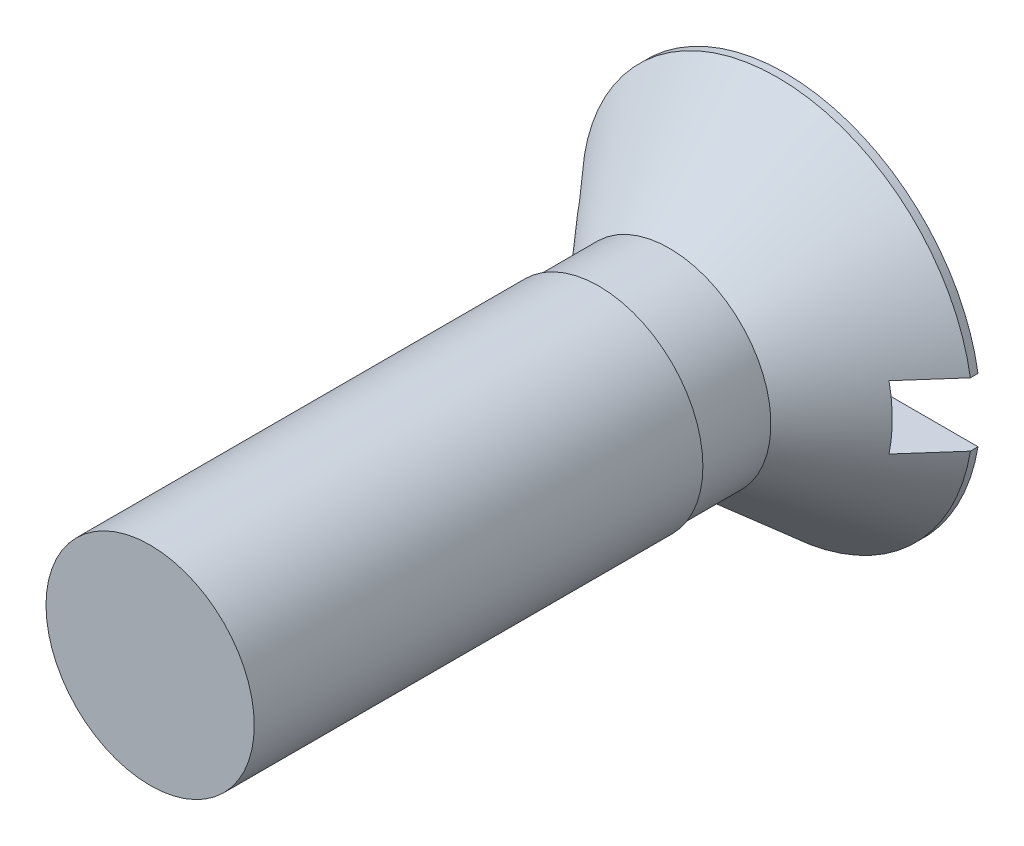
ISO-10303-21;
HEADER;
FILE_DESCRIPTION(('STEP AP214'),'2;1');
FILE_NAME('part.step','',(''),(''),'','','');
FILE_SCHEMA(('AUTOMOTIVE_DESIGN { 1 0 10303 214 1 1 1 1 }'));
ENDSEC;
DATA;
#1=APPLICATION_CONTEXT('core data for automotive mechanical design processes');
#2=APPLICATION_PROTOCOL_DEFINITION('international standard','automotive_design',2000,#1);
#3=PRODUCT_CONTEXT('',#1,'mechanical');
#4=PRODUCT('Part','Part','',(#3));
#5=PRODUCT_RELATED_PRODUCT_CATEGORY('part','',(#4));
#6=PRODUCT_DEFINITION_FORMATION('','',#4);
#7=PRODUCT_DEFINITION_CONTEXT('part definition',#1,'design');
#8=PRODUCT_DEFINITION('design','',#6,#7);
#9=PRODUCT_DEFINITION_SHAPE('','',#8);
#10=(LENGTH_UNIT() NAMED_UNIT(*) SI_UNIT(.MILLI.,.METRE.));
#11=(NAMED_UNIT(*) PLANE_ANGLE_UNIT() SI_UNIT($,.RADIAN.));
#12=(NAMED_UNIT(*) SI_UNIT($,.STERADIAN.) SOLID_ANGLE_UNIT());
#13=UNCERTAINTY_MEASURE_WITH_UNIT(LENGTH_MEASURE(1.E-05),#10,'distance_accuracy_value','');
#14=(GEOMETRIC_REPRESENTATION_CONTEXT(3) GLOBAL_UNCERTAINTY_ASSIGNED_CONTEXT((#13)) GLOBAL_UNIT_ASSIGNED_CONTEXT((#10,
#11,#12)) REPRESENTATION_CONTEXT('',''));
#15=CARTESIAN_POINT('',(0.,0.,0.));
#16=DIRECTION('',(0.,0.,1.));
#17=DIRECTION('',(1.,0.,0.));
#18=AXIS2_PLACEMENT_3D('',#15,#16,#17);
#19=CARTESIAN_POINT('',(0.,0.,0.));
#20=DIRECTION('',(0.,0.,-1.));
#21=DIRECTION('',(-1.,0.,0.));
#22=AXIS2_PLACEMENT_3D('',#19,#20,#21);
#23=PLANE('',#22);
#24=DIRECTION('',(1.,0.,0.));
#25=VECTOR('',#24,1.);
#26=CARTESIAN_POINT('',(-5.08,-0.635,0.));
#27=LINE('',#26,#25);
#28=CARTESIAN_POINT('',(-3.8597136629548,-0.635,0.));
#29=VERTEX_POINT('',#28);
#30=CARTESIAN_POINT('',(3.8597136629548,-0.635,0.));
#31=VERTEX_POINT('',#30);
#32=EDGE_CURVE('E103',#29,#31,#27,.T.);
#33=ORIENTED_EDGE('',*,*,#32,.T.);
#34=CARTESIAN_POINT('',(0.,0.,0.));
#35=DIRECTION('',(0.,0.,-1.));
#36=DIRECTION('',(-1.,0.,0.));
#37=AXIS2_PLACEMENT_3D('',#34,#35,#36);
#38=CIRCLE('',#37,3.9116);
#39=EDGE_CURVE('E110',#31,#29,#38,.T.);
#40=ORIENTED_EDGE('',*,*,#39,.T.);
#41=EDGE_LOOP('',(#33,#40));
#42=FACE_BOUND('',#41,.T.);
#43=ADVANCED_FACE('F35',(#42),#23,.T.);
#44=CARTESIAN_POINT('',(0.,0.,0.));
#45=DIRECTION('',(0.,0.,-1.));
#46=DIRECTION('',(-1.,0.,0.));
#47=AXIS2_PLACEMENT_3D('',#44,#45,#46);
#48=CYLINDRICAL_SURFACE('',#47,3.9116);
#49=DIRECTION('',(0.,0.,-1.));
#50=VECTOR('',#49,1.);
#51=CARTESIAN_POINT('',(-3.8597136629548,-0.635,0.));
#52=LINE('',#51,#50);
#53=CARTESIAN_POINT('',(-3.8597136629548,-0.635,0.1524));
#54=VERTEX_POINT('',#53);
#55=EDGE_CURVE('E64',#29,#54,#52,.F.);
#56=ORIENTED_EDGE('',*,*,#55,.F.);
#57=ORIENTED_EDGE('',*,*,#39,.F.);
#58=DIRECTION('',(0.,0.,-1.));
#59=VECTOR('',#58,1.);
#60=CARTESIAN_POINT('',(3.8597136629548,-0.635,0.));
#61=LINE('',#60,#59);
#62=CARTESIAN_POINT('',(3.85971366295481,-0.635,0.152399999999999));
#63=VERTEX_POINT('',#62);
#64=EDGE_CURVE('E222',#63,#31,#61,.T.);
#65=ORIENTED_EDGE('',*,*,#64,.F.);
#66=CARTESIAN_POINT('',(0.,0.,0.1524));
#67=DIRECTION('',(0.,0.,-1.));
#68=DIRECTION('',(-1.,0.,0.));
#69=AXIS2_PLACEMENT_3D('',#66,#67,#68);
#70=CIRCLE('',#69,3.9116);
#71=EDGE_CURVE('E205',#63,#54,#70,.T.);
#72=ORIENTED_EDGE('',*,*,#71,.T.);
#73=EDGE_LOOP('',(#56,#57,#65,#72));
#74=FACE_BOUND('',#73,.T.);
#75=ADVANCED_FACE('F153',(#74),#48,.T.);
#76=DIRECTION('',(1.,0.,0.));
#77=VECTOR('',#76,1.);
#78=CARTESIAN_POINT('',(-5.08,0.635,0.));
#79=LINE('',#78,#77);
#80=CARTESIAN_POINT('',(-3.8597136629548,0.635,0.));
#81=VERTEX_POINT('',#80);
#82=CARTESIAN_POINT('',(3.8597136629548,0.635,0.));
#83=VERTEX_POINT('',#82);
#84=EDGE_CURVE('E94',#81,#83,#79,.T.);
#85=ORIENTED_EDGE('',*,*,#84,.F.);
#86=EDGE_CURVE('E107',#81,#83,#38,.T.);
#87=ORIENTED_EDGE('',*,*,#86,.T.);
#88=EDGE_LOOP('',(#85,#87));
#89=FACE_BOUND('',#88,.T.);
#90=ADVANCED_FACE('F37',(#89),#23,.T.);
#91=DIRECTION('',(0.,0.,-1.));
#92=VECTOR('',#91,1.);
#93=CARTESIAN_POINT('',(3.8597136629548,0.635,0.));
#94=LINE('',#93,#92);
#95=CARTESIAN_POINT('',(3.8597136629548,0.635,0.1524));
#96=VERTEX_POINT('',#95);
#97=EDGE_CURVE('E102',#83,#96,#94,.F.);
#98=ORIENTED_EDGE('',*,*,#97,.F.);
#99=ORIENTED_EDGE('',*,*,#86,.F.);
#100=DIRECTION('',(0.,0.,-1.));
#101=VECTOR('',#100,1.);
#102=CARTESIAN_POINT('',(-3.8597136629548,0.635,0.));
#103=LINE('',#102,#101);
#104=CARTESIAN_POINT('',(-3.85971366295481,0.635,0.152399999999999));
#105=VERTEX_POINT('',#104);
#106=EDGE_CURVE('E91',#105,#81,#103,.T.);
#107=ORIENTED_EDGE('',*,*,#106,.F.);
#108=EDGE_CURVE('E116',#105,#96,#70,.T.);
#109=ORIENTED_EDGE('',*,*,#108,.T.);
#110=EDGE_LOOP('',(#98,#99,#107,#109));
#111=FACE_BOUND('',#110,.T.);
#112=ADVANCED_FACE('F109',(#111),#48,.T.);
#113=CARTESIAN_POINT('',(0.,0.,0.1524));
#114=DIRECTION('',(0.,0.,-1.));
#115=DIRECTION('',(-1.,0.,0.));
#116=AXIS2_PLACEMENT_3D('',#113,#114,#115);
#117=CONICAL_SURFACE('',#116,3.9116,0.71558499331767);
#118=CARTESIAN_POINT('',(-7.99173442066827,-0.635,-4.57023313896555));
#119=CARTESIAN_POINT('',(-7.73015099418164,-0.635,-4.27026768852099));
#120=CARTESIAN_POINT('',(-7.46852776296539,-0.635,-3.97033691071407));
#121=CARTESIAN_POINT('',(-6.94515075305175,-0.635,-3.3705804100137));
#122=CARTESIAN_POINT('',(-6.68339697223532,-0.635,-3.07075468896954));
#123=CARTESIAN_POINT('',(-6.15956292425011,-0.635,-2.47107804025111));
#124=CARTESIAN_POINT('',(-5.89748255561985,-0.635,-2.17122720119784));
#125=CARTESIAN_POINT('',(-5.37307124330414,-0.635,-1.5717531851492));
#126=CARTESIAN_POINT('',(-5.11074030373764,-0.635,-1.27213000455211));
#127=CARTESIAN_POINT('',(-4.57870079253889,-0.635,-0.665271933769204));
#128=CARTESIAN_POINT('',(-4.30898149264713,-0.635,-0.358046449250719));
#129=CARTESIAN_POINT('',(-3.76882942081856,-0.635,0.255803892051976));
#130=CARTESIAN_POINT('',(-3.49839661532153,-0.635,0.562428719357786));
#131=CARTESIAN_POINT('',(-3.09177052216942,-0.635,1.02138672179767));
#132=CARTESIAN_POINT('',(-2.95609413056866,-0.635,1.17417769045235));
#133=CARTESIAN_POINT('',(-2.68421962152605,-0.635,1.47929994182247));
#134=CARTESIAN_POINT('',(-2.54802149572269,-0.635,1.63163121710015));
#135=CARTESIAN_POINT('',(-2.27482307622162,-0.635,1.93554831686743));
#136=CARTESIAN_POINT('',(-2.13782285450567,-0.635,2.08713420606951));
#137=CARTESIAN_POINT('',(-1.86247040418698,-0.635,2.38907180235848));
#138=CARTESIAN_POINT('',(-1.72411822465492,-0.635,2.53942355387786));
#139=CARTESIAN_POINT('',(-1.5485620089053,-0.635,2.72686842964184));
#140=CARTESIAN_POINT('',(-1.51258423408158,-0.635,2.76510891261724));
#141=CARTESIAN_POINT('',(-1.44040934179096,-0.635,2.84138308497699));
#142=CARTESIAN_POINT('',(-1.40421222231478,-0.635,2.87941677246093));
#143=CARTESIAN_POINT('',(-1.29519944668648,-0.635,2.99316605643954));
#144=CARTESIAN_POINT('',(-1.22198767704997,-0.635,3.06850272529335));
#145=CARTESIAN_POINT('',(-1.07399410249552,-0.635,3.21749954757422));
#146=CARTESIAN_POINT('',(-0.999213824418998,-0.635,3.29116119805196));
#147=CARTESIAN_POINT('',(-0.884962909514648,-0.635,3.39942515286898));
#148=CARTESIAN_POINT('',(-0.846542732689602,-0.635,3.43513276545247));
#149=CARTESIAN_POINT('',(-0.768748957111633,-0.635,3.505490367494));
#150=CARTESIAN_POINT('',(-0.729375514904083,-0.635,3.5401405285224));
#151=CARTESIAN_POINT('',(-0.662706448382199,-0.635,3.5965455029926));
#152=CARTESIAN_POINT('',(-0.635779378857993,-0.635,3.61873457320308));
#153=CARTESIAN_POINT('',(-0.581177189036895,-0.635,3.66219417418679));
#154=CARTESIAN_POINT('',(-0.553501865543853,-0.635,3.68346445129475));
#155=CARTESIAN_POINT('',(-0.497246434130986,-0.635,3.7247178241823));
#156=CARTESIAN_POINT('',(-0.468667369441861,-0.635,3.74470232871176));
#157=CARTESIAN_POINT('',(-0.4103482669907,-0.635,3.78288293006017));
#158=CARTESIAN_POINT('',(-0.380608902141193,-0.635,3.80108004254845));
#159=CARTESIAN_POINT('',(-0.315874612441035,-0.635,3.837042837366));
#160=CARTESIAN_POINT('',(-0.280687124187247,-0.635,3.85447093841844));
#161=CARTESIAN_POINT('',(-0.20826519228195,-0.635,3.88438630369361));
#162=CARTESIAN_POINT('',(-0.171035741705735,-0.635,3.8968850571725));
#163=CARTESIAN_POINT('',(-0.101467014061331,-0.635,3.91327562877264));
#164=CARTESIAN_POINT('',(-0.0694015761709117,-0.635,3.91828535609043));
#165=CARTESIAN_POINT('',(-0.00489928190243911,-0.635,3.92261073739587));
#166=CARTESIAN_POINT('',(0.0275371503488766,-0.635,3.92193234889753));
#167=CARTESIAN_POINT('',(0.0916735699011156,-0.635,3.91503973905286));
#168=CARTESIAN_POINT('',(0.123375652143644,-0.635,3.9088439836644));
#169=CARTESIAN_POINT('',(0.185547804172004,-0.635,3.89194936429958));
#170=CARTESIAN_POINT('',(0.216016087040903,-0.635,3.88124420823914));
#171=CARTESIAN_POINT('',(0.284207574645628,-0.635,3.85293620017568));
#172=CARTESIAN_POINT('',(0.321461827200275,-0.635,3.83423263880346));
#173=CARTESIAN_POINT('',(0.393997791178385,-0.635,3.79327961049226));
#174=CARTESIAN_POINT('',(0.429275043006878,-0.635,3.77102253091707));
#175=CARTESIAN_POINT('',(0.4985625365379,-0.635,3.72400991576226));
#176=CARTESIAN_POINT('',(0.532558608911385,-0.635,3.69923379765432));
#177=CARTESIAN_POINT('',(0.599304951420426,-0.635,3.64814401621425));
#178=CARTESIAN_POINT('',(0.632056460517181,-0.635,3.62183195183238));
#179=CARTESIAN_POINT('',(0.699854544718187,-0.635,3.56545159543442));
#180=CARTESIAN_POINT('',(0.734806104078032,-0.635,3.53526974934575));
#181=CARTESIAN_POINT('',(0.803887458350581,-0.635,3.47397683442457));
#182=CARTESIAN_POINT('',(0.838017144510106,-0.635,3.44286564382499));
#183=CARTESIAN_POINT('',(0.939507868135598,-0.635,3.34850595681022));
#184=CARTESIAN_POINT('',(1.00593812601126,-0.635,3.28425921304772));
#185=CARTESIAN_POINT('',(1.13740327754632,-0.635,3.15413543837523));
#186=CARTESIAN_POINT('',(1.20243540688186,-0.635,3.08825564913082));
#187=CARTESIAN_POINT('',(1.33147999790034,-0.635,2.95554205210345));
#188=CARTESIAN_POINT('',(1.39549273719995,-0.635,2.88870851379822));
#189=CARTESIAN_POINT('',(1.52258225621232,-0.635,2.75465036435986));
#190=CARTESIAN_POINT('',(1.58566170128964,-0.635,2.68742827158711));
#191=CARTESIAN_POINT('',(1.71133312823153,-0.635,2.55252176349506));
#192=CARTESIAN_POINT('',(1.77392507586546,-0.635,2.48483731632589));
#193=CARTESIAN_POINT('',(1.89867677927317,-0.635,2.34920673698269));
#194=CARTESIAN_POINT('',(1.96083692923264,-0.635,2.28126096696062));
#195=CARTESIAN_POINT('',(2.08487759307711,-0.635,2.14511777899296));
#196=CARTESIAN_POINT('',(2.1467581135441,-0.635,2.07692036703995));
#197=CARTESIAN_POINT('',(2.33105513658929,-0.635,1.87316946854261));
#198=CARTESIAN_POINT('',(2.45315770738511,-0.635,1.73733211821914));
#199=CARTESIAN_POINT('',(2.69682304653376,-0.635,1.4651738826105));
#200=CARTESIAN_POINT('',(2.81838581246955,-0.635,1.32885299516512));
#201=CARTESIAN_POINT('',(3.18253586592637,-0.635,0.919402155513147));
#202=CARTESIAN_POINT('',(3.42458006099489,-0.635,0.645789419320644));
#203=CARTESIAN_POINT('',(3.90805042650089,-0.635,0.097762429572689));
#204=CARTESIAN_POINT('',(4.14947620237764,-0.635,-0.176652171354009));
#205=CARTESIAN_POINT('',(4.63187517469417,-0.635,-0.725874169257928));
#206=CARTESIAN_POINT('',(4.87284837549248,-0.635,-1.000681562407));
#207=CARTESIAN_POINT('',(5.35395902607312,-0.635,-1.54991938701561));
#208=CARTESIAN_POINT('',(5.59409712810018,-0.635,-1.82434924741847));
#209=CARTESIAN_POINT('',(6.07418012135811,-0.635,-2.37337947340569));
#210=CARTESIAN_POINT('',(6.31412501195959,-0.635,-2.64797983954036));
#211=CARTESIAN_POINT('',(6.79373810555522,-0.635,-3.19713975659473));
#212=CARTESIAN_POINT('',(7.03340638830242,-0.635,-3.4716992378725));
#213=CARTESIAN_POINT('',(7.51263939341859,-0.635,-4.02090686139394));
#214=CARTESIAN_POINT('',(7.75220411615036,-0.635,-4.29555500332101));
#215=CARTESIAN_POINT('',(7.99173442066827,-0.635,-4.57023313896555));
#216=B_SPLINE_CURVE_WITH_KNOTS('',3,(#118,#119,#120,#121,#122,#123,#124,#125,#126,#127,#128,
#129,#130,#131,#132,#133,#134,#135,#136,#137,#138,#139,#140,#141,#142,#143,#144,#145,#146,#147,
#148,#149,#150,#151,#152,#153,#154,#155,#156,#157,#158,#159,#160,#161,#162,#163,#164,#165,#166,
#167,#168,#169,#170,#171,#172,#173,#174,#175,#176,#177,#178,#179,#180,#181,#182,#183,#184,#185,
#186,#187,#188,#189,#190,#191,#192,#193,#194,#195,#196,#197,#198,#199,#200,#201,#202,#203,#204,
#205,#206,#207,#208,#209,#210,#211,#212,#213,#214,#215),.UNSPECIFIED.,.F.,.F.,(4,2,2,2,2,2,2,2,
2,2,2,2,2,2,2,2,2,2,2,2,2,2,2,2,2,2,2,2,2,2,2,2,2,2,2,2,2,2,2,2,2,2,2,2,2,2,2,2,4),(0.,
1.19400441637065,2.38802888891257,3.58275464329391,4.77746108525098,6.00392888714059,
7.23045544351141,7.84346258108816,8.45647958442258,9.06944239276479,9.68238303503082,
9.83989616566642,9.9974107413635,10.3125512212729,10.6273979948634,10.7847399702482,
10.9420562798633,11.0467163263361,11.1514050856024,11.2559771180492,11.3604893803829,
11.4780514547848,11.5953378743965,11.6922518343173,11.7890643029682,11.8855539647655,
11.9821787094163,12.1069217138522,12.2319356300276,12.3580686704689,12.4840726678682,
12.6225879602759,12.7611214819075,13.0383167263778,13.3160172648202,13.5936408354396,
13.8701887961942,14.1467560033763,14.4230241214,14.6992857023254,15.2472314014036,
15.7951795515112,16.8910976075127,17.9875952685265,19.0840823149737,20.1780669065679,
21.2720550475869,22.3654049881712,23.4587510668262),.UNSPECIFIED.);
#217=CARTESIAN_POINT('',(3.09644352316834,-0.635,1.016));
#218=VERTEX_POINT('',#217);
#219=EDGE_CURVE('E11',#218,#63,#216,.T.);
#220=ORIENTED_EDGE('',*,*,#219,.F.);
#221=CARTESIAN_POINT('',(0.,0.,1.016));
#222=DIRECTION('',(0.,0.,1.));
#223=DIRECTION('',(1.,0.,0.));
#224=AXIS2_PLACEMENT_3D('',#221,#222,#223);
#225=CIRCLE('',#224,3.16088397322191);
#226=CARTESIAN_POINT('',(3.09644352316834,0.635,1.016));
#227=VERTEX_POINT('',#226);
#228=EDGE_CURVE('E49',#227,#218,#225,.F.);
#229=ORIENTED_EDGE('',*,*,#228,.F.);
#230=CARTESIAN_POINT('',(7.99173442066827,0.635,-4.57023313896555));
#231=CARTESIAN_POINT('',(7.73015099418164,0.635,-4.27026768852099));
#232=CARTESIAN_POINT('',(7.46852776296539,0.635,-3.97033691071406));
#233=CARTESIAN_POINT('',(6.94515075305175,0.635,-3.3705804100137));
#234=CARTESIAN_POINT('',(6.68339697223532,0.635,-3.07075468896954));
#235=CARTESIAN_POINT('',(6.15956292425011,0.635,-2.47107804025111));
#236=CARTESIAN_POINT('',(5.89748255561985,0.635,-2.17122720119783));
#237=CARTESIAN_POINT('',(5.37307124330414,0.635,-1.5717531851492));
#238=CARTESIAN_POINT('',(5.11074030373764,0.635,-1.2721300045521));
#239=CARTESIAN_POINT('',(4.57870079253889,0.635,-0.665271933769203));
#240=CARTESIAN_POINT('',(4.30898149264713,0.635,-0.358046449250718));
#241=CARTESIAN_POINT('',(3.76882942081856,0.635,0.255803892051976));
#242=CARTESIAN_POINT('',(3.49839661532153,0.635,0.562428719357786));
#243=CARTESIAN_POINT('',(3.09177052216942,0.635,1.02138672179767));
#244=CARTESIAN_POINT('',(2.95609413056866,0.635,1.17417769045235));
#245=CARTESIAN_POINT('',(2.68421962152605,0.635,1.47929994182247));
#246=CARTESIAN_POINT('',(2.54802149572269,0.635,1.63163121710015));
#247=CARTESIAN_POINT('',(2.27482307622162,0.635,1.93554831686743));
#248=CARTESIAN_POINT('',(2.13782285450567,0.635,2.08713420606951));
#249=CARTESIAN_POINT('',(1.86247040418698,0.635,2.38907180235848));
#250=CARTESIAN_POINT('',(1.72411822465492,0.635,2.53942355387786));
#251=CARTESIAN_POINT('',(1.5485620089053,0.635,2.72686842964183));
#252=CARTESIAN_POINT('',(1.51258423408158,0.635,2.76510891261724));
#253=CARTESIAN_POINT('',(1.44040934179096,0.635,2.84138308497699));
#254=CARTESIAN_POINT('',(1.40421222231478,0.635,2.87941677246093));
#255=CARTESIAN_POINT('',(1.29519944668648,0.635,2.99316605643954));
#256=CARTESIAN_POINT('',(1.22198767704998,0.635,3.06850272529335));
#257=CARTESIAN_POINT('',(1.07399410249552,0.635,3.21749954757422));
#258=CARTESIAN_POINT('',(0.999213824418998,0.635,3.29116119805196));
#259=CARTESIAN_POINT('',(0.884962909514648,0.635,3.39942515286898));
#260=CARTESIAN_POINT('',(0.846542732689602,0.635,3.43513276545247));
#261=CARTESIAN_POINT('',(0.768748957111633,0.635,3.505490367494));
#262=CARTESIAN_POINT('',(0.729375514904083,0.635,3.5401405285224));
#263=CARTESIAN_POINT('',(0.662706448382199,0.635,3.5965455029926));
#264=CARTESIAN_POINT('',(0.635779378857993,0.635,3.61873457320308));
#265=CARTESIAN_POINT('',(0.581177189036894,0.635,3.66219417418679));
#266=CARTESIAN_POINT('',(0.553501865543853,0.635,3.68346445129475));
#267=CARTESIAN_POINT('',(0.497246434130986,0.635,3.7247178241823));
#268=CARTESIAN_POINT('',(0.468667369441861,0.635,3.74470232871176));
#269=CARTESIAN_POINT('',(0.4103482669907,0.635,3.78288293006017));
#270=CARTESIAN_POINT('',(0.380608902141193,0.635,3.80108004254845));
#271=CARTESIAN_POINT('',(0.315874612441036,0.635,3.837042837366));
#272=CARTESIAN_POINT('',(0.280687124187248,0.635,3.85447093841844));
#273=CARTESIAN_POINT('',(0.208265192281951,0.635,3.88438630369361));
#274=CARTESIAN_POINT('',(0.171035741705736,0.635,3.8968850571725));
#275=CARTESIAN_POINT('',(0.101467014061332,0.635,3.91327562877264));
#276=CARTESIAN_POINT('',(0.0694015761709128,0.635,3.91828535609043));
#277=CARTESIAN_POINT('',(0.00489928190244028,0.635,3.92261073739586));
#278=CARTESIAN_POINT('',(-0.027537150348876,0.635,3.92193234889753));
#279=CARTESIAN_POINT('',(-0.0916735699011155,0.635,3.91503973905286));
#280=CARTESIAN_POINT('',(-0.123375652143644,0.635,3.9088439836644));
#281=CARTESIAN_POINT('',(-0.185547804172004,0.635,3.89194936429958));
#282=CARTESIAN_POINT('',(-0.216016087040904,0.635,3.88124420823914));
#283=CARTESIAN_POINT('',(-0.284207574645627,0.635,3.85293620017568));
#284=CARTESIAN_POINT('',(-0.321461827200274,0.635,3.83423263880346));
#285=CARTESIAN_POINT('',(-0.393997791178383,0.635,3.79327961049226));
#286=CARTESIAN_POINT('',(-0.429275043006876,0.635,3.77102253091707));
#287=CARTESIAN_POINT('',(-0.498562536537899,0.635,3.72400991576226));
#288=CARTESIAN_POINT('',(-0.532558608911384,0.635,3.69923379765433));
#289=CARTESIAN_POINT('',(-0.599304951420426,0.635,3.64814401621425));
#290=CARTESIAN_POINT('',(-0.632056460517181,0.635,3.62183195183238));
#291=CARTESIAN_POINT('',(-0.699854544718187,0.635,3.56545159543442));
#292=CARTESIAN_POINT('',(-0.734806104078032,0.635,3.53526974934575));
#293=CARTESIAN_POINT('',(-0.803887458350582,0.635,3.47397683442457));
#294=CARTESIAN_POINT('',(-0.838017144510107,0.635,3.44286564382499));
#295=CARTESIAN_POINT('',(-0.939507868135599,0.635,3.34850595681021));
#296=CARTESIAN_POINT('',(-1.00593812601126,0.635,3.28425921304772));
#297=CARTESIAN_POINT('',(-1.13740327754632,0.635,3.15413543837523));
#298=CARTESIAN_POINT('',(-1.20243540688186,0.635,3.08825564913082));
#299=CARTESIAN_POINT('',(-1.33147999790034,0.635,2.95554205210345));
#300=CARTESIAN_POINT('',(-1.39549273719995,0.635,2.88870851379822));
#301=CARTESIAN_POINT('',(-1.52258225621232,0.635,2.75465036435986));
#302=CARTESIAN_POINT('',(-1.58566170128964,0.635,2.68742827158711));
#303=CARTESIAN_POINT('',(-1.71133312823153,0.635,2.55252176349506));
#304=CARTESIAN_POINT('',(-1.77392507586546,0.635,2.48483731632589));
#305=CARTESIAN_POINT('',(-1.89867677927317,0.635,2.34920673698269));
#306=CARTESIAN_POINT('',(-1.96083692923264,0.635,2.28126096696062));
#307=CARTESIAN_POINT('',(-2.08487759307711,0.635,2.14511777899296));
#308=CARTESIAN_POINT('',(-2.1467581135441,0.635,2.07692036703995));
#309=CARTESIAN_POINT('',(-2.33105513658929,0.635,1.87316946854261));
#310=CARTESIAN_POINT('',(-2.45315770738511,0.635,1.73733211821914));
#311=CARTESIAN_POINT('',(-2.69682304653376,0.635,1.4651738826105));
#312=CARTESIAN_POINT('',(-2.81838581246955,0.635,1.32885299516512));
#313=CARTESIAN_POINT('',(-3.18253586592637,0.635,0.919402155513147));
#314=CARTESIAN_POINT('',(-3.42458006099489,0.635,0.645789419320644));
#315=CARTESIAN_POINT('',(-3.90805042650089,0.635,0.0977624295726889));
#316=CARTESIAN_POINT('',(-4.14947620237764,0.635,-0.176652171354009));
#317=CARTESIAN_POINT('',(-4.63187517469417,0.635,-0.725874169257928));
#318=CARTESIAN_POINT('',(-4.87284837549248,0.635,-1.000681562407));
#319=CARTESIAN_POINT('',(-5.35395902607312,0.635,-1.54991938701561));
#320=CARTESIAN_POINT('',(-5.59409712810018,0.635,-1.82434924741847));
#321=CARTESIAN_POINT('',(-6.07418012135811,0.635,-2.37337947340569));
#322=CARTESIAN_POINT('',(-6.31412501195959,0.635,-2.64797983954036));
#323=CARTESIAN_POINT('',(-6.79373810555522,0.635,-3.19713975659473));
#324=CARTESIAN_POINT('',(-7.03340638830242,0.635,-3.4716992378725));
#325=CARTESIAN_POINT('',(-7.51263939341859,0.635,-4.02090686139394));
#326=CARTESIAN_POINT('',(-7.75220411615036,0.635,-4.29555500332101));
#327=CARTESIAN_POINT('',(-7.99173442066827,0.635,-4.57023313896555));
#328=B_SPLINE_CURVE_WITH_KNOTS('',3,(#230,#231,#232,#233,#234,#235,#236,#237,#238,#239,#240,
#241,#242,#243,#244,#245,#246,#247,#248,#249,#250,#251,#252,#253,#254,#255,#256,#257,#258,#259,
#260,#261,#262,#263,#264,#265,#266,#267,#268,#269,#270,#271,#272,#273,#274,#275,#276,#277,#278,
#279,#280,#281,#282,#283,#284,#285,#286,#287,#288,#289,#290,#291,#292,#293,#294,#295,#296,#297,
#298,#299,#300,#301,#302,#303,#304,#305,#306,#307,#308,#309,#310,#311,#312,#313,#314,#315,#316,
#317,#318,#319,#320,#321,#322,#323,#324,#325,#326,#327),.UNSPECIFIED.,.F.,.F.,(4,2,2,2,2,2,2,2,
2,2,2,2,2,2,2,2,2,2,2,2,2,2,2,2,2,2,2,2,2,2,2,2,2,2,2,2,2,2,2,2,2,2,2,2,2,2,2,2,4),(0.,
1.19400441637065,2.38802888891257,3.58275464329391,4.77746108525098,6.00392888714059,
7.23045544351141,7.84346258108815,8.45647958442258,9.06944239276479,9.68238303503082,
9.83989616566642,9.99741074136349,10.3125512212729,10.6273979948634,10.7847399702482,
10.9420562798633,11.0467163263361,11.1514050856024,11.2559771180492,11.3604893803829,
11.4780514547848,11.5953378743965,11.6922518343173,11.7890643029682,11.8855539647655,
11.9821787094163,12.1069217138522,12.2319356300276,12.3580686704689,12.4840726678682,
12.6225879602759,12.7611214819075,13.0383167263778,13.3160172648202,13.5936408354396,
13.8701887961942,14.1467560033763,14.4230241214,14.6992857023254,15.2472314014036,
15.7951795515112,16.8910976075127,17.9875952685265,19.0840823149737,20.1780669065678,
21.2720550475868,22.3654049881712,23.4587510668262),.UNSPECIFIED.);
#329=EDGE_CURVE('E114',#96,#227,#328,.T.);
#330=ORIENTED_EDGE('',*,*,#329,.F.);
#331=ORIENTED_EDGE('',*,*,#108,.F.);
#332=CARTESIAN_POINT('',(-3.09644352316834,0.635,1.016));
#333=VERTEX_POINT('',#332);
#334=EDGE_CURVE('E97',#333,#105,#328,.T.);
#335=ORIENTED_EDGE('',*,*,#334,.F.);
#336=CARTESIAN_POINT('',(-3.09644352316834,-0.635,1.016));
#337=VERTEX_POINT('',#336);
#338=EDGE_CURVE('E112',#337,#333,#225,.F.);
#339=ORIENTED_EDGE('',*,*,#338,.F.);
#340=EDGE_CURVE('E39',#54,#337,#216,.T.);
#341=ORIENTED_EDGE('',*,*,#340,.F.);
#342=ORIENTED_EDGE('',*,*,#71,.F.);
#343=EDGE_LOOP('',(#220,#229,#330,#331,#335,#339,#341,#342));
#344=FACE_BOUND('',#343,.T.);
#345=CARTESIAN_POINT('',(0.,0.,2.31463245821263));
#346=DIRECTION('',(0.,0.,-1.));
#347=DIRECTION('',(-1.,0.,0.));
#348=AXIS2_PLACEMENT_3D('',#345,#346,#347);
#349=CIRCLE('',#348,2.032);
#350=CARTESIAN_POINT('',(-2.032,0.,2.31463245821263));
#351=VERTEX_POINT('',#350);
#352=EDGE_CURVE('E207',#351,#351,#349,.T.);
#353=ORIENTED_EDGE('',*,*,#352,.T.);
#354=EDGE_LOOP('',(#353));
#355=FACE_BOUND('',#354,.T.);
#356=ADVANCED_FACE('F123',(#344,#355),#117,.T.);
#357=CARTESIAN_POINT('',(0.,0.,0.));
#358=DIRECTION('',(0.,0.,-1.));
#359=DIRECTION('',(-1.,0.,0.));
#360=AXIS2_PLACEMENT_3D('',#357,#358,#359);
#361=CYLINDRICAL_SURFACE('',#360,2.032);
#362=CARTESIAN_POINT('',(0.,0.,3.72574356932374));
#363=DIRECTION('',(0.,0.,-1.));
#364=DIRECTION('',(-1.,0.,0.));
#365=AXIS2_PLACEMENT_3D('',#362,#363,#364);
#366=CIRCLE('',#365,2.032);
#367=CARTESIAN_POINT('',(-2.032,0.,3.72574356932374));
#368=VERTEX_POINT('',#367);
#369=EDGE_CURVE('E211',#368,#368,#366,.T.);
#370=ORIENTED_EDGE('',*,*,#369,.T.);
#371=EDGE_LOOP('',(#370));
#372=FACE_BOUND('',#371,.T.);
#373=ORIENTED_EDGE('',*,*,#352,.F.);
#374=EDGE_LOOP('',(#373));
#375=FACE_BOUND('',#374,.T.);
#376=ADVANCED_FACE('F142',(#372,#375),#361,.T.);
#377=CARTESIAN_POINT('',(0.,2.032,3.72574356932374));
#378=DIRECTION('',(0.,0.,-1.));
#379=DIRECTION('',(-1.,0.,0.));
#380=AXIS2_PLACEMENT_3D('',#377,#378,#379);
#381=PLANE('',#380);
#382=CARTESIAN_POINT('',(0.,0.,3.72574356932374));
#383=DIRECTION('',(0.,0.,-1.));
#384=DIRECTION('',(-1.,0.,0.));
#385=AXIS2_PLACEMENT_3D('',#382,#383,#384);
#386=CIRCLE('',#385,2.0828);
#387=CARTESIAN_POINT('',(-2.0828,0.,3.72574356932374));
#388=VERTEX_POINT('',#387);
#389=EDGE_CURVE('E213',#388,#388,#386,.T.);
#390=ORIENTED_EDGE('',*,*,#389,.T.);
#391=EDGE_LOOP('',(#390));
#392=FACE_BOUND('',#391,.T.);
#393=ORIENTED_EDGE('',*,*,#369,.F.);
#394=EDGE_LOOP('',(#393));
#395=FACE_BOUND('',#394,.T.);
#396=ADVANCED_FACE('F139',(#392,#395),#381,.T.);
#397=CARTESIAN_POINT('',(0.,0.,0.));
#398=DIRECTION('',(0.,0.,-1.));
#399=DIRECTION('',(-1.,0.,0.));
#400=AXIS2_PLACEMENT_3D('',#397,#398,#399);
#401=CYLINDRICAL_SURFACE('',#400,2.0828);
#402=CARTESIAN_POINT('',(0.,0.,12.7));
#403=DIRECTION('',(0.,0.,-1.));
#404=DIRECTION('',(-1.,0.,0.));
#405=AXIS2_PLACEMENT_3D('',#402,#403,#404);
#406=CIRCLE('',#405,2.0828);
#407=CARTESIAN_POINT('',(-2.0828,0.,12.7));
#408=VERTEX_POINT('',#407);
#409=EDGE_CURVE('E218',#408,#408,#406,.T.);
#410=ORIENTED_EDGE('',*,*,#409,.T.);
#411=EDGE_LOOP('',(#410));
#412=FACE_BOUND('',#411,.T.);
#413=ORIENTED_EDGE('',*,*,#389,.F.);
#414=EDGE_LOOP('',(#413));
#415=FACE_BOUND('',#414,.T.);
#416=ADVANCED_FACE('F135',(#412,#415),#401,.T.);
#417=CARTESIAN_POINT('',(0.,2.0828,12.7));
#418=DIRECTION('',(0.,0.,1.));
#419=DIRECTION('',(1.,0.,0.));
#420=AXIS2_PLACEMENT_3D('',#417,#418,#419);
#421=PLANE('',#420);
#422=ORIENTED_EDGE('',*,*,#409,.F.);
#423=EDGE_LOOP('',(#422));
#424=FACE_BOUND('',#423,.T.);
#425=ADVANCED_FACE('F131',(#424),#421,.T.);
#426=CARTESIAN_POINT('',(-5.08,-0.635,0.));
#427=DIRECTION('',(0.,-1.,0.));
#428=DIRECTION('',(0.,0.,-1.));
#429=AXIS2_PLACEMENT_3D('',#426,#427,#428);
#430=PLANE('',#429);
#431=ORIENTED_EDGE('',*,*,#55,.T.);
#432=ORIENTED_EDGE('',*,*,#340,.T.);
#433=DIRECTION('',(1.,0.,0.));
#434=VECTOR('',#433,1.);
#435=CARTESIAN_POINT('',(-5.08,-0.635,1.016));
#436=LINE('',#435,#434);
#437=EDGE_CURVE('E201',#337,#218,#436,.T.);
#438=ORIENTED_EDGE('',*,*,#437,.T.);
#439=ORIENTED_EDGE('',*,*,#219,.T.);
#440=ORIENTED_EDGE('',*,*,#64,.T.);
#441=ORIENTED_EDGE('',*,*,#32,.F.);
#442=EDGE_LOOP('',(#431,#432,#438,#439,#440,#441));
#443=FACE_BOUND('',#442,.T.);
#444=ADVANCED_FACE('F134',(#443),#430,.F.);
#445=CARTESIAN_POINT('',(-5.08,0.635,1.016));
#446=DIRECTION('',(0.,0.,1.));
#447=DIRECTION('',(1.,0.,0.));
#448=AXIS2_PLACEMENT_3D('',#445,#446,#447);
#449=PLANE('',#448);
#450=ORIENTED_EDGE('',*,*,#338,.T.);
#451=DIRECTION('',(1.,0.,0.));
#452=VECTOR('',#451,1.);
#453=CARTESIAN_POINT('',(-5.08,0.635,1.016));
#454=LINE('',#453,#452);
#455=EDGE_CURVE('E56',#333,#227,#454,.T.);
#456=ORIENTED_EDGE('',*,*,#455,.T.);
#457=ORIENTED_EDGE('',*,*,#228,.T.);
#458=ORIENTED_EDGE('',*,*,#437,.F.);
#459=EDGE_LOOP('',(#450,#456,#457,#458));
#460=FACE_BOUND('',#459,.T.);
#461=ADVANCED_FACE('F130',(#460),#449,.F.);
#462=CARTESIAN_POINT('',(-5.08,0.635,0.));
#463=DIRECTION('',(0.,1.,0.));
#464=DIRECTION('',(0.,0.,1.));
#465=AXIS2_PLACEMENT_3D('',#462,#463,#464);
#466=PLANE('',#465);
#467=ORIENTED_EDGE('',*,*,#97,.T.);
#468=ORIENTED_EDGE('',*,*,#329,.T.);
#469=ORIENTED_EDGE('',*,*,#455,.F.);
#470=ORIENTED_EDGE('',*,*,#334,.T.);
#471=ORIENTED_EDGE('',*,*,#106,.T.);
#472=ORIENTED_EDGE('',*,*,#84,.T.);
#473=EDGE_LOOP('',(#467,#468,#469,#470,#471,#472));
#474=FACE_BOUND('',#473,.T.);
#475=ADVANCED_FACE('F93',(#474),#466,.F.);
#476=CLOSED_SHELL('',(#43,#75,#90,#112,#356,#376,#396,#416,#425,#444,#461,#475));
#477=MANIFOLD_SOLID_BREP('B2',#476);
#478=ADVANCED_BREP_SHAPE_REPRESENTATION('',(#18,#477),#14);
#479=SHAPE_DEFINITION_REPRESENTATION(#9,#478);
ENDSEC;
END-ISO-10303-21;
